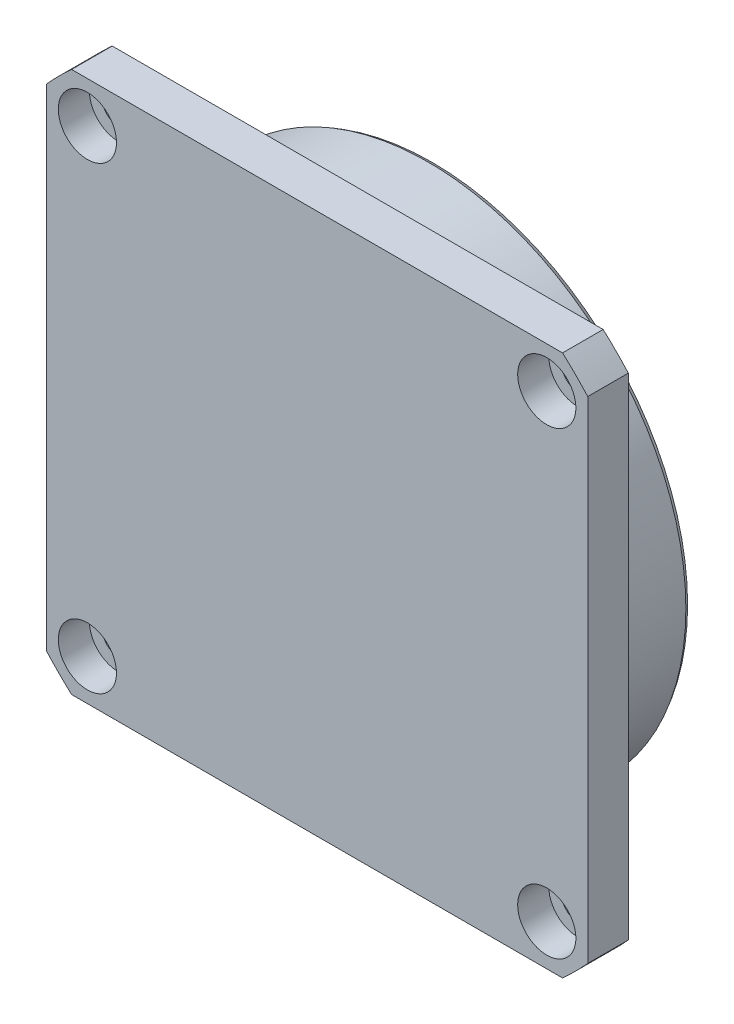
ISO-10303-21;
HEADER;
FILE_DESCRIPTION(('STEP AP214'),'2;1');
FILE_NAME('part.step','',(''),(''),'','','');
FILE_SCHEMA(('AUTOMOTIVE_DESIGN { 1 0 10303 214 1 1 1 1 }'));
ENDSEC;
DATA;
#1=APPLICATION_CONTEXT('core data for automotive mechanical design processes');
#2=APPLICATION_PROTOCOL_DEFINITION('international standard','automotive_design',2000,#1);
#3=PRODUCT_CONTEXT('',#1,'mechanical');
#4=PRODUCT('Part','Part','',(#3));
#5=PRODUCT_RELATED_PRODUCT_CATEGORY('part','',(#4));
#6=PRODUCT_DEFINITION_FORMATION('','',#4);
#7=PRODUCT_DEFINITION_CONTEXT('part definition',#1,'design');
#8=PRODUCT_DEFINITION('design','',#6,#7);
#9=PRODUCT_DEFINITION_SHAPE('','',#8);
#10=(LENGTH_UNIT() NAMED_UNIT(*) SI_UNIT(.MILLI.,.METRE.));
#11=(NAMED_UNIT(*) PLANE_ANGLE_UNIT() SI_UNIT($,.RADIAN.));
#12=(NAMED_UNIT(*) SI_UNIT($,.STERADIAN.) SOLID_ANGLE_UNIT());
#13=UNCERTAINTY_MEASURE_WITH_UNIT(LENGTH_MEASURE(1.E-05),#10,'distance_accuracy_value','');
#14=(GEOMETRIC_REPRESENTATION_CONTEXT(3) GLOBAL_UNCERTAINTY_ASSIGNED_CONTEXT((#13)) GLOBAL_UNIT_ASSIGNED_CONTEXT((#10,
#11,#12)) REPRESENTATION_CONTEXT('',''));
#15=CARTESIAN_POINT('',(0.,0.,0.));
#16=DIRECTION('',(0.,0.,1.));
#17=DIRECTION('',(1.,0.,0.));
#18=AXIS2_PLACEMENT_3D('',#15,#16,#17);
#19=CARTESIAN_POINT('',(0.,0.,1.5));
#20=DIRECTION('',(0.,0.,1.));
#21=DIRECTION('',(1.,0.,0.));
#22=AXIS2_PLACEMENT_3D('',#19,#20,#21);
#23=PLANE('',#22);
#24=CARTESIAN_POINT('',(0.,0.,1.5));
#25=DIRECTION('',(0.,0.,1.));
#26=DIRECTION('',(1.,0.,0.));
#27=AXIS2_PLACEMENT_3D('',#24,#25,#26);
#28=CIRCLE('',#27,14.);
#29=CARTESIAN_POINT('',(14.,0.,1.5));
#30=VERTEX_POINT('',#29);
#31=EDGE_CURVE('E250',#30,#30,#28,.F.);
#32=ORIENTED_EDGE('',*,*,#31,.T.);
#33=EDGE_LOOP('',(#32));
#34=FACE_BOUND('',#33,.T.);
#35=ADVANCED_FACE('F17',(#34),#23,.F.);
#36=CARTESIAN_POINT('',(0.,0.,0.5));
#37=DIRECTION('',(0.,0.,1.));
#38=DIRECTION('',(-1.,0.,0.));
#39=AXIS2_PLACEMENT_3D('',#36,#37,#38);
#40=TOROIDAL_SURFACE('',#39,14.,1.);
#41=CARTESIAN_POINT('',(0.,0.,0.5));
#42=DIRECTION('',(0.,0.,1.));
#43=DIRECTION('',(1.,0.,0.));
#44=AXIS2_PLACEMENT_3D('',#41,#42,#43);
#45=CIRCLE('',#44,15.);
#46=CARTESIAN_POINT('',(15.,0.,0.5));
#47=VERTEX_POINT('',#46);
#48=EDGE_CURVE('E241',#47,#47,#45,.F.);
#49=ORIENTED_EDGE('',*,*,#48,.T.);
#50=EDGE_LOOP('',(#49));
#51=FACE_BOUND('',#50,.T.);
#52=ORIENTED_EDGE('',*,*,#31,.F.);
#53=EDGE_LOOP('',(#52));
#54=FACE_BOUND('',#53,.T.);
#55=ADVANCED_FACE('F257',(#51,#54),#40,.F.);
#56=CARTESIAN_POINT('',(0.,0.,-5.5));
#57=DIRECTION('',(0.,0.,1.));
#58=DIRECTION('',(1.,0.,0.));
#59=AXIS2_PLACEMENT_3D('',#56,#57,#58);
#60=CYLINDRICAL_SURFACE('',#59,15.);
#61=CARTESIAN_POINT('',(0.,0.,-5.));
#62=DIRECTION('',(0.,0.,-1.));
#63=DIRECTION('',(1.,0.,0.));
#64=AXIS2_PLACEMENT_3D('',#61,#62,#63);
#65=CIRCLE('',#64,15.);
#66=CARTESIAN_POINT('',(15.,0.,-5.));
#67=VERTEX_POINT('',#66);
#68=EDGE_CURVE('E249',#67,#67,#65,.F.);
#69=ORIENTED_EDGE('',*,*,#68,.F.);
#70=EDGE_LOOP('',(#69));
#71=FACE_BOUND('',#70,.T.);
#72=ORIENTED_EDGE('',*,*,#48,.F.);
#73=EDGE_LOOP('',(#72));
#74=FACE_BOUND('',#73,.T.);
#75=ADVANCED_FACE('F233',(#71,#74),#60,.F.);
#76=CARTESIAN_POINT('',(0.,0.,-5.));
#77=DIRECTION('',(0.,0.,-1.));
#78=DIRECTION('',(1.,0.,0.));
#79=AXIS2_PLACEMENT_3D('',#76,#77,#78);
#80=TOROIDAL_SURFACE('',#79,15.5,0.5);
#81=CARTESIAN_POINT('',(0.,0.,-5.5));
#82=DIRECTION('',(0.,0.,-1.));
#83=DIRECTION('',(-1.,0.,0.));
#84=AXIS2_PLACEMENT_3D('',#81,#82,#83);
#85=CIRCLE('',#84,15.5);
#86=CARTESIAN_POINT('',(-15.5,0.,-5.5));
#87=VERTEX_POINT('',#86);
#88=EDGE_CURVE('E210',#87,#87,#85,.F.);
#89=ORIENTED_EDGE('',*,*,#88,.F.);
#90=EDGE_LOOP('',(#89));
#91=FACE_BOUND('',#90,.T.);
#92=ORIENTED_EDGE('',*,*,#68,.T.);
#93=EDGE_LOOP('',(#92));
#94=FACE_BOUND('',#93,.T.);
#95=ADVANCED_FACE('F228',(#91,#94),#80,.T.);
#96=CARTESIAN_POINT('',(0.,0.,-5.5));
#97=DIRECTION('',(0.,0.,-1.));
#98=DIRECTION('',(-1.,0.,0.));
#99=AXIS2_PLACEMENT_3D('',#96,#97,#98);
#100=PLANE('',#99);
#101=CARTESIAN_POINT('',(0.,0.,-5.5));
#102=DIRECTION('',(0.,0.,1.));
#103=DIRECTION('',(1.,0.,0.));
#104=AXIS2_PLACEMENT_3D('',#101,#102,#103);
#105=CIRCLE('',#104,18.8767949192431);
#106=CARTESIAN_POINT('',(18.8767949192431,0.,-5.5));
#107=VERTEX_POINT('',#106);
#108=EDGE_CURVE('E21',#107,#107,#105,.T.);
#109=ORIENTED_EDGE('',*,*,#108,.F.);
#110=EDGE_LOOP('',(#109));
#111=FACE_BOUND('',#110,.T.);
#112=ORIENTED_EDGE('',*,*,#88,.T.);
#113=EDGE_LOOP('',(#112));
#114=FACE_BOUND('',#113,.T.);
#115=ADVANCED_FACE('F217',(#111,#114),#100,.T.);
#116=CARTESIAN_POINT('',(0.,0.,-5.19999999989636));
#117=DIRECTION('',(0.,0.,1.));
#118=DIRECTION('',(1.,0.,0.));
#119=AXIS2_PLACEMENT_3D('',#116,#117,#118);
#120=CONICAL_SURFACE('',#119,19.0499999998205,0.523598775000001);
#121=ORIENTED_EDGE('',*,*,#108,.T.);
#122=EDGE_LOOP('',(#121));
#123=FACE_BOUND('',#122,.T.);
#124=CARTESIAN_POINT('',(0.,0.,-5.2));
#125=DIRECTION('',(0.,0.,-1.));
#126=DIRECTION('',(-1.,0.,0.));
#127=AXIS2_PLACEMENT_3D('',#124,#125,#126);
#128=CIRCLE('',#127,19.05);
#129=CARTESIAN_POINT('',(-19.05,0.,-5.2));
#130=VERTEX_POINT('',#129);
#131=EDGE_CURVE('E199',#130,#130,#128,.F.);
#132=ORIENTED_EDGE('',*,*,#131,.F.);
#133=EDGE_LOOP('',(#132));
#134=FACE_BOUND('',#133,.T.);
#135=ADVANCED_FACE('F227',(#123,#134),#120,.T.);
#136=CARTESIAN_POINT('',(0.,0.,0.));
#137=DIRECTION('',(0.,0.,-1.));
#138=DIRECTION('',(-1.,0.,0.));
#139=AXIS2_PLACEMENT_3D('',#136,#137,#138);
#140=CYLINDRICAL_SURFACE('',#139,19.05);
#141=ORIENTED_EDGE('',*,*,#131,.T.);
#142=EDGE_LOOP('',(#141));
#143=FACE_BOUND('',#142,.T.);
#144=CARTESIAN_POINT('',(0.,0.,-0.853589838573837));
#145=DIRECTION('',(0.,0.,-1.));
#146=DIRECTION('',(1.,0.,0.));
#147=AXIS2_PLACEMENT_3D('',#144,#145,#146);
#148=CIRCLE('',#147,19.0499999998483);
#149=CARTESIAN_POINT('',(19.0499999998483,0.,-0.853589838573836));
#150=VERTEX_POINT('',#149);
#151=EDGE_CURVE('E186',#150,#150,#148,.F.);
#152=ORIENTED_EDGE('',*,*,#151,.F.);
#153=EDGE_LOOP('',(#152));
#154=FACE_BOUND('',#153,.T.);
#155=ADVANCED_FACE('F512',(#143,#154),#140,.T.);
#156=CARTESIAN_POINT('',(0.,0.,-0.853589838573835));
#157=DIRECTION('',(0.,0.,-1.));
#158=DIRECTION('',(0.,1.,0.));
#159=AXIS2_PLACEMENT_3D('',#156,#157,#158);
#160=CONICAL_SURFACE('',#159,19.0499999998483,0.523598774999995);
#161=CARTESIAN_POINT('',(0.,0.,-0.599999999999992));
#162=DIRECTION('',(0.,0.,-1.));
#163=DIRECTION('',(1.,0.,0.));
#164=AXIS2_PLACEMENT_3D('',#161,#162,#163);
#165=CIRCLE('',#164,18.9035898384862);
#166=CARTESIAN_POINT('',(18.9035898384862,0.,-0.599999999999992));
#167=VERTEX_POINT('',#166);
#168=EDGE_CURVE('E182',#167,#167,#165,.T.);
#169=ORIENTED_EDGE('',*,*,#168,.T.);
#170=EDGE_LOOP('',(#169));
#171=FACE_BOUND('',#170,.T.);
#172=ORIENTED_EDGE('',*,*,#151,.T.);
#173=EDGE_LOOP('',(#172));
#174=FACE_BOUND('',#173,.T.);
#175=ADVANCED_FACE('F176',(#171,#174),#160,.T.);
#176=CARTESIAN_POINT('',(0.,0.,-0.400000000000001));
#177=DIRECTION('',(0.,0.,-1.));
#178=DIRECTION('',(1.,0.,0.));
#179=AXIS2_PLACEMENT_3D('',#176,#177,#178);
#180=TOROIDAL_SURFACE('',#179,19.25,0.4);
#181=CARTESIAN_POINT('',(0.,0.,0.));
#182=DIRECTION('',(0.,0.,-1.));
#183=DIRECTION('',(-1.,0.,0.));
#184=AXIS2_PLACEMENT_3D('',#181,#182,#183);
#185=CIRCLE('',#184,19.25);
#186=CARTESIAN_POINT('',(-19.25,0.,0.));
#187=VERTEX_POINT('',#186);
#188=EDGE_CURVE('E121',#187,#187,#185,.F.);
#189=ORIENTED_EDGE('',*,*,#188,.F.);
#190=EDGE_LOOP('',(#189));
#191=FACE_BOUND('',#190,.T.);
#192=ORIENTED_EDGE('',*,*,#168,.F.);
#193=EDGE_LOOP('',(#192));
#194=FACE_BOUND('',#193,.T.);
#195=ADVANCED_FACE('F170',(#191,#194),#180,.F.);
#196=CARTESIAN_POINT('',(-16.9705627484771,-16.9705627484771,-495001.999614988));
#197=DIRECTION('',(0.,0.,-1.));
#198=DIRECTION('',(-1.,0.,0.));
#199=AXIS2_PLACEMENT_3D('',#196,#197,#198);
#200=CYLINDRICAL_SURFACE('',#199,1.2);
#201=CARTESIAN_POINT('',(-16.9705627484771,-16.9705627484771,0.699999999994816));
#202=DIRECTION('',(0.,0.,-1.));
#203=DIRECTION('',(-1.,0.,0.));
#204=AXIS2_PLACEMENT_3D('',#201,#202,#203);
#205=CIRCLE('',#204,1.2);
#206=CARTESIAN_POINT('',(-18.1705627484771,-16.9705627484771,0.699999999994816));
#207=VERTEX_POINT('',#206);
#208=EDGE_CURVE('E324',#207,#207,#205,.F.);
#209=ORIENTED_EDGE('',*,*,#208,.T.);
#210=EDGE_LOOP('',(#209));
#211=FACE_BOUND('',#210,.T.);
#212=CARTESIAN_POINT('',(-16.9705627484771,-16.9705627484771,0.));
#213=DIRECTION('',(0.,0.,-1.));
#214=DIRECTION('',(-1.,0.,0.));
#215=AXIS2_PLACEMENT_3D('',#212,#213,#214);
#216=CIRCLE('',#215,1.2);
#217=CARTESIAN_POINT('',(-18.1705627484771,-16.9705627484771,0.));
#218=VERTEX_POINT('',#217);
#219=EDGE_CURVE('E321',#218,#218,#216,.F.);
#220=ORIENTED_EDGE('',*,*,#219,.F.);
#221=EDGE_LOOP('',(#220));
#222=FACE_BOUND('',#221,.T.);
#223=ADVANCED_FACE('F166',(#211,#222),#200,.F.);
#224=CARTESIAN_POINT('',(-16.9705627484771,16.9705627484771,-495001.999614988));
#225=DIRECTION('',(0.,0.,-1.));
#226=DIRECTION('',(-1.,0.,0.));
#227=AXIS2_PLACEMENT_3D('',#224,#225,#226);
#228=CYLINDRICAL_SURFACE('',#227,1.2);
#229=CARTESIAN_POINT('',(-16.9705627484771,16.9705627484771,0.699999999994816));
#230=DIRECTION('',(0.,0.,-1.));
#231=DIRECTION('',(-1.,0.,0.));
#232=AXIS2_PLACEMENT_3D('',#229,#230,#231);
#233=CIRCLE('',#232,1.2);
#234=CARTESIAN_POINT('',(-18.1705627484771,16.9705627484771,0.699999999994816));
#235=VERTEX_POINT('',#234);
#236=EDGE_CURVE('E327',#235,#235,#233,.F.);
#237=ORIENTED_EDGE('',*,*,#236,.T.);
#238=EDGE_LOOP('',(#237));
#239=FACE_BOUND('',#238,.T.);
#240=CARTESIAN_POINT('',(-16.9705627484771,16.9705627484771,0.));
#241=DIRECTION('',(0.,0.,-1.));
#242=DIRECTION('',(-1.,0.,0.));
#243=AXIS2_PLACEMENT_3D('',#240,#241,#242);
#244=CIRCLE('',#243,1.2);
#245=CARTESIAN_POINT('',(-18.1705627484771,16.9705627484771,0.));
#246=VERTEX_POINT('',#245);
#247=EDGE_CURVE('E318',#246,#246,#244,.F.);
#248=ORIENTED_EDGE('',*,*,#247,.F.);
#249=EDGE_LOOP('',(#248));
#250=FACE_BOUND('',#249,.T.);
#251=ADVANCED_FACE('F162',(#239,#250),#228,.F.);
#252=CARTESIAN_POINT('',(16.9705627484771,16.9705627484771,-495001.999614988));
#253=DIRECTION('',(0.,0.,-1.));
#254=DIRECTION('',(-1.,0.,0.));
#255=AXIS2_PLACEMENT_3D('',#252,#253,#254);
#256=CYLINDRICAL_SURFACE('',#255,1.2);
#257=CARTESIAN_POINT('',(16.9705627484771,16.9705627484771,0.699999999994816));
#258=DIRECTION('',(0.,0.,-1.));
#259=DIRECTION('',(-1.,0.,0.));
#260=AXIS2_PLACEMENT_3D('',#257,#258,#259);
#261=CIRCLE('',#260,1.2);
#262=CARTESIAN_POINT('',(15.7705627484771,16.9705627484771,0.699999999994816));
#263=VERTEX_POINT('',#262);
#264=EDGE_CURVE('E330',#263,#263,#261,.F.);
#265=ORIENTED_EDGE('',*,*,#264,.T.);
#266=EDGE_LOOP('',(#265));
#267=FACE_BOUND('',#266,.T.);
#268=CARTESIAN_POINT('',(16.9705627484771,16.9705627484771,0.));
#269=DIRECTION('',(0.,0.,-1.));
#270=DIRECTION('',(-1.,0.,0.));
#271=AXIS2_PLACEMENT_3D('',#268,#269,#270);
#272=CIRCLE('',#271,1.2);
#273=CARTESIAN_POINT('',(15.7705627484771,16.9705627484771,0.));
#274=VERTEX_POINT('',#273);
#275=EDGE_CURVE('E315',#274,#274,#272,.F.);
#276=ORIENTED_EDGE('',*,*,#275,.F.);
#277=EDGE_LOOP('',(#276));
#278=FACE_BOUND('',#277,.T.);
#279=ADVANCED_FACE('F158',(#267,#278),#256,.F.);
#280=CARTESIAN_POINT('',(16.9705627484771,-16.9705627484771,-495001.999614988));
#281=DIRECTION('',(0.,0.,-1.));
#282=DIRECTION('',(-1.,0.,0.));
#283=AXIS2_PLACEMENT_3D('',#280,#281,#282);
#284=CYLINDRICAL_SURFACE('',#283,1.2);
#285=CARTESIAN_POINT('',(16.9705627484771,-16.9705627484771,0.699999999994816));
#286=DIRECTION('',(0.,0.,-1.));
#287=DIRECTION('',(-1.,0.,0.));
#288=AXIS2_PLACEMENT_3D('',#285,#286,#287);
#289=CIRCLE('',#288,1.2);
#290=CARTESIAN_POINT('',(15.7705627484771,-16.9705627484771,0.699999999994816));
#291=VERTEX_POINT('',#290);
#292=EDGE_CURVE('E185',#291,#291,#289,.F.);
#293=ORIENTED_EDGE('',*,*,#292,.T.);
#294=EDGE_LOOP('',(#293));
#295=FACE_BOUND('',#294,.T.);
#296=CARTESIAN_POINT('',(16.9705627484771,-16.9705627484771,0.));
#297=DIRECTION('',(0.,0.,-1.));
#298=DIRECTION('',(-1.,0.,0.));
#299=AXIS2_PLACEMENT_3D('',#296,#297,#298);
#300=CIRCLE('',#299,1.2);
#301=CARTESIAN_POINT('',(15.7705627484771,-16.9705627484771,0.));
#302=VERTEX_POINT('',#301);
#303=EDGE_CURVE('E312',#302,#302,#300,.F.);
#304=ORIENTED_EDGE('',*,*,#303,.F.);
#305=EDGE_LOOP('',(#304));
#306=FACE_BOUND('',#305,.T.);
#307=ADVANCED_FACE('F154',(#295,#306),#284,.F.);
#308=CARTESIAN_POINT('',(16.9705627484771,-16.9705627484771,0.7));
#309=DIRECTION('',(0.,0.,-1.));
#310=DIRECTION('',(-1.,0.,0.));
#311=AXIS2_PLACEMENT_3D('',#308,#309,#310);
#312=PLANE('',#311);
#313=CARTESIAN_POINT('',(16.9705627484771,-16.9705627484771,0.7));
#314=DIRECTION('',(0.,0.,-1.));
#315=DIRECTION('',(-1.,0.,0.));
#316=AXIS2_PLACEMENT_3D('',#313,#314,#315);
#317=CIRCLE('',#316,2.15);
#318=CARTESIAN_POINT('',(14.8205627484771,-16.9705627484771,0.7));
#319=VERTEX_POINT('',#318);
#320=EDGE_CURVE('E309',#319,#319,#317,.F.);
#321=ORIENTED_EDGE('',*,*,#320,.T.);
#322=EDGE_LOOP('',(#321));
#323=FACE_BOUND('',#322,.T.);
#324=ORIENTED_EDGE('',*,*,#292,.F.);
#325=EDGE_LOOP('',(#324));
#326=FACE_BOUND('',#325,.T.);
#327=ADVANCED_FACE('F150',(#323,#326),#312,.F.);
#328=CARTESIAN_POINT('',(16.9705627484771,16.9705627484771,0.7));
#329=DIRECTION('',(0.,0.,-1.));
#330=DIRECTION('',(-1.,0.,0.));
#331=AXIS2_PLACEMENT_3D('',#328,#329,#330);
#332=PLANE('',#331);
#333=CARTESIAN_POINT('',(16.9705627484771,16.9705627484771,0.7));
#334=DIRECTION('',(0.,0.,-1.));
#335=DIRECTION('',(-1.,0.,0.));
#336=AXIS2_PLACEMENT_3D('',#333,#334,#335);
#337=CIRCLE('',#336,2.15);
#338=CARTESIAN_POINT('',(14.8205627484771,16.9705627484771,0.7));
#339=VERTEX_POINT('',#338);
#340=EDGE_CURVE('E306',#339,#339,#337,.F.);
#341=ORIENTED_EDGE('',*,*,#340,.T.);
#342=EDGE_LOOP('',(#341));
#343=FACE_BOUND('',#342,.T.);
#344=ORIENTED_EDGE('',*,*,#264,.F.);
#345=EDGE_LOOP('',(#344));
#346=FACE_BOUND('',#345,.T.);
#347=ADVANCED_FACE('F146',(#343,#346),#332,.F.);
#348=CARTESIAN_POINT('',(-16.9705627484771,16.9705627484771,0.7));
#349=DIRECTION('',(0.,0.,-1.));
#350=DIRECTION('',(-1.,0.,0.));
#351=AXIS2_PLACEMENT_3D('',#348,#349,#350);
#352=PLANE('',#351);
#353=CARTESIAN_POINT('',(-16.9705627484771,16.9705627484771,0.7));
#354=DIRECTION('',(0.,0.,-1.));
#355=DIRECTION('',(-1.,0.,0.));
#356=AXIS2_PLACEMENT_3D('',#353,#354,#355);
#357=CIRCLE('',#356,2.15);
#358=CARTESIAN_POINT('',(-19.1205627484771,16.9705627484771,0.7));
#359=VERTEX_POINT('',#358);
#360=EDGE_CURVE('E303',#359,#359,#357,.F.);
#361=ORIENTED_EDGE('',*,*,#360,.T.);
#362=EDGE_LOOP('',(#361));
#363=FACE_BOUND('',#362,.T.);
#364=ORIENTED_EDGE('',*,*,#236,.F.);
#365=EDGE_LOOP('',(#364));
#366=FACE_BOUND('',#365,.T.);
#367=ADVANCED_FACE('F142',(#363,#366),#352,.F.);
#368=CARTESIAN_POINT('',(-16.9705627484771,-16.9705627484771,0.7));
#369=DIRECTION('',(0.,0.,-1.));
#370=DIRECTION('',(-1.,0.,0.));
#371=AXIS2_PLACEMENT_3D('',#368,#369,#370);
#372=PLANE('',#371);
#373=CARTESIAN_POINT('',(-16.9705627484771,-16.9705627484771,0.7));
#374=DIRECTION('',(0.,0.,-1.));
#375=DIRECTION('',(-1.,0.,0.));
#376=AXIS2_PLACEMENT_3D('',#373,#374,#375);
#377=CIRCLE('',#376,2.15);
#378=CARTESIAN_POINT('',(-19.1205627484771,-16.9705627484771,0.7));
#379=VERTEX_POINT('',#378);
#380=EDGE_CURVE('E104',#379,#379,#377,.F.);
#381=ORIENTED_EDGE('',*,*,#380,.T.);
#382=EDGE_LOOP('',(#381));
#383=FACE_BOUND('',#382,.T.);
#384=ORIENTED_EDGE('',*,*,#208,.F.);
#385=EDGE_LOOP('',(#384));
#386=FACE_BOUND('',#385,.T.);
#387=ADVANCED_FACE('F137',(#383,#386),#372,.F.);
#388=CARTESIAN_POINT('',(0.,0.,0.));
#389=DIRECTION('',(0.,0.,-1.));
#390=DIRECTION('',(-1.,0.,0.));
#391=AXIS2_PLACEMENT_3D('',#388,#389,#390);
#392=PLANE('',#391);
#393=ORIENTED_EDGE('',*,*,#303,.T.);
#394=EDGE_LOOP('',(#393));
#395=FACE_BOUND('',#394,.T.);
#396=ORIENTED_EDGE('',*,*,#275,.T.);
#397=EDGE_LOOP('',(#396));
#398=FACE_BOUND('',#397,.T.);
#399=ORIENTED_EDGE('',*,*,#247,.T.);
#400=EDGE_LOOP('',(#399));
#401=FACE_BOUND('',#400,.T.);
#402=ORIENTED_EDGE('',*,*,#219,.T.);
#403=EDGE_LOOP('',(#402));
#404=FACE_BOUND('',#403,.T.);
#405=CARTESIAN_POINT('',(0.,0.,0.));
#406=DIRECTION('',(0.,0.,-1.));
#407=DIRECTION('',(-1.,0.,0.));
#408=AXIS2_PLACEMENT_3D('',#405,#406,#407);
#409=CIRCLE('',#408,27.);
#410=CARTESIAN_POINT('',(18.1383571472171,-20.,0.));
#411=VERTEX_POINT('',#410);
#412=CARTESIAN_POINT('',(20.,-18.1383571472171,0.));
#413=VERTEX_POINT('',#412);
#414=EDGE_CURVE('E296',#411,#413,#409,.F.);
#415=ORIENTED_EDGE('',*,*,#414,.F.);
#416=DIRECTION('',(1.,0.,0.));
#417=VECTOR('',#416,1.);
#418=CARTESIAN_POINT('',(0.,-20.,0.));
#419=LINE('',#418,#417);
#420=CARTESIAN_POINT('',(-18.1383571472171,-20.,0.));
#421=VERTEX_POINT('',#420);
#422=EDGE_CURVE('E114',#421,#411,#419,.T.);
#423=ORIENTED_EDGE('',*,*,#422,.F.);
#424=CARTESIAN_POINT('',(0.,0.,0.));
#425=DIRECTION('',(0.,0.,-1.));
#426=DIRECTION('',(-1.,0.,0.));
#427=AXIS2_PLACEMENT_3D('',#424,#425,#426);
#428=CIRCLE('',#427,27.);
#429=CARTESIAN_POINT('',(-20.,-18.1383571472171,0.));
#430=VERTEX_POINT('',#429);
#431=EDGE_CURVE('E100',#430,#421,#428,.F.);
#432=ORIENTED_EDGE('',*,*,#431,.F.);
#433=DIRECTION('',(0.,1.,0.));
#434=VECTOR('',#433,1.);
#435=CARTESIAN_POINT('',(-20.,18.1383571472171,0.));
#436=LINE('',#435,#434);
#437=CARTESIAN_POINT('',(-20.,18.1383571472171,0.));
#438=VERTEX_POINT('',#437);
#439=EDGE_CURVE('E93',#430,#438,#436,.T.);
#440=ORIENTED_EDGE('',*,*,#439,.T.);
#441=CARTESIAN_POINT('',(0.,0.,0.));
#442=DIRECTION('',(0.,0.,-1.));
#443=DIRECTION('',(-1.,0.,0.));
#444=AXIS2_PLACEMENT_3D('',#441,#442,#443);
#445=CIRCLE('',#444,27.);
#446=CARTESIAN_POINT('',(-18.1383571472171,20.,0.));
#447=VERTEX_POINT('',#446);
#448=EDGE_CURVE('E84',#447,#438,#445,.F.);
#449=ORIENTED_EDGE('',*,*,#448,.F.);
#450=DIRECTION('',(1.,0.,0.));
#451=VECTOR('',#450,1.);
#452=CARTESIAN_POINT('',(0.,20.,0.));
#453=LINE('',#452,#451);
#454=CARTESIAN_POINT('',(18.1383571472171,20.,0.));
#455=VERTEX_POINT('',#454);
#456=EDGE_CURVE('E79',#455,#447,#453,.F.);
#457=ORIENTED_EDGE('',*,*,#456,.F.);
#458=CARTESIAN_POINT('',(0.,0.,0.));
#459=DIRECTION('',(0.,0.,-1.));
#460=DIRECTION('',(-1.,0.,0.));
#461=AXIS2_PLACEMENT_3D('',#458,#459,#460);
#462=CIRCLE('',#461,27.);
#463=CARTESIAN_POINT('',(20.,18.1383571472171,0.));
#464=VERTEX_POINT('',#463);
#465=EDGE_CURVE('E298',#464,#455,#462,.F.);
#466=ORIENTED_EDGE('',*,*,#465,.F.);
#467=DIRECTION('',(0.,1.,0.));
#468=VECTOR('',#467,1.);
#469=CARTESIAN_POINT('',(20.,-18.1383571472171,0.));
#470=LINE('',#469,#468);
#471=EDGE_CURVE('E126',#464,#413,#470,.F.);
#472=ORIENTED_EDGE('',*,*,#471,.T.);
#473=EDGE_LOOP('',(#415,#423,#432,#440,#449,#457,#466,#472));
#474=FACE_BOUND('',#473,.T.);
#475=ORIENTED_EDGE('',*,*,#188,.T.);
#476=EDGE_LOOP('',(#475));
#477=FACE_BOUND('',#476,.T.);
#478=ADVANCED_FACE('F97',(#395,#398,#401,#404,#474,#477),#392,.T.);
#479=CARTESIAN_POINT('',(16.9705627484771,-16.9705627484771,3.));
#480=DIRECTION('',(0.,0.,-1.));
#481=DIRECTION('',(-1.,0.,0.));
#482=AXIS2_PLACEMENT_3D('',#479,#480,#481);
#483=CYLINDRICAL_SURFACE('',#482,2.15);
#484=CARTESIAN_POINT('',(16.9705627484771,-16.9705627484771,3.));
#485=DIRECTION('',(0.,0.,-1.));
#486=DIRECTION('',(-1.,0.,0.));
#487=AXIS2_PLACEMENT_3D('',#484,#485,#486);
#488=CIRCLE('',#487,2.15);
#489=CARTESIAN_POINT('',(14.8205627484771,-16.9705627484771,3.));
#490=VERTEX_POINT('',#489);
#491=EDGE_CURVE('E291',#490,#490,#488,.F.);
#492=ORIENTED_EDGE('',*,*,#491,.T.);
#493=EDGE_LOOP('',(#492));
#494=FACE_BOUND('',#493,.T.);
#495=ORIENTED_EDGE('',*,*,#320,.F.);
#496=EDGE_LOOP('',(#495));
#497=FACE_BOUND('',#496,.T.);
#498=ADVANCED_FACE('F136',(#494,#497),#483,.F.);
#499=CARTESIAN_POINT('',(16.9705627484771,16.9705627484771,3.));
#500=DIRECTION('',(0.,0.,-1.));
#501=DIRECTION('',(-1.,0.,0.));
#502=AXIS2_PLACEMENT_3D('',#499,#500,#501);
#503=CYLINDRICAL_SURFACE('',#502,2.15);
#504=CARTESIAN_POINT('',(16.9705627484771,16.9705627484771,3.));
#505=DIRECTION('',(0.,0.,-1.));
#506=DIRECTION('',(-1.,0.,0.));
#507=AXIS2_PLACEMENT_3D('',#504,#505,#506);
#508=CIRCLE('',#507,2.15);
#509=CARTESIAN_POINT('',(14.8205627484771,16.9705627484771,3.));
#510=VERTEX_POINT('',#509);
#511=EDGE_CURVE('E288',#510,#510,#508,.F.);
#512=ORIENTED_EDGE('',*,*,#511,.T.);
#513=EDGE_LOOP('',(#512));
#514=FACE_BOUND('',#513,.T.);
#515=ORIENTED_EDGE('',*,*,#340,.F.);
#516=EDGE_LOOP('',(#515));
#517=FACE_BOUND('',#516,.T.);
#518=ADVANCED_FACE('F355',(#514,#517),#503,.F.);
#519=CARTESIAN_POINT('',(-16.9705627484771,16.9705627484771,3.));
#520=DIRECTION('',(0.,0.,-1.));
#521=DIRECTION('',(-1.,0.,0.));
#522=AXIS2_PLACEMENT_3D('',#519,#520,#521);
#523=CYLINDRICAL_SURFACE('',#522,2.15);
#524=CARTESIAN_POINT('',(-16.9705627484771,16.9705627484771,3.));
#525=DIRECTION('',(0.,0.,-1.));
#526=DIRECTION('',(-1.,0.,0.));
#527=AXIS2_PLACEMENT_3D('',#524,#525,#526);
#528=CIRCLE('',#527,2.15);
#529=CARTESIAN_POINT('',(-19.1205627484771,16.9705627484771,3.));
#530=VERTEX_POINT('',#529);
#531=EDGE_CURVE('E285',#530,#530,#528,.F.);
#532=ORIENTED_EDGE('',*,*,#531,.T.);
#533=EDGE_LOOP('',(#532));
#534=FACE_BOUND('',#533,.T.);
#535=ORIENTED_EDGE('',*,*,#360,.F.);
#536=EDGE_LOOP('',(#535));
#537=FACE_BOUND('',#536,.T.);
#538=ADVANCED_FACE('F361',(#534,#537),#523,.F.);
#539=CARTESIAN_POINT('',(-16.9705627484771,-16.9705627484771,3.));
#540=DIRECTION('',(0.,0.,-1.));
#541=DIRECTION('',(-1.,0.,0.));
#542=AXIS2_PLACEMENT_3D('',#539,#540,#541);
#543=CYLINDRICAL_SURFACE('',#542,2.15);
#544=CARTESIAN_POINT('',(-16.9705627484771,-16.9705627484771,3.));
#545=DIRECTION('',(0.,0.,-1.));
#546=DIRECTION('',(-1.,0.,0.));
#547=AXIS2_PLACEMENT_3D('',#544,#545,#546);
#548=CIRCLE('',#547,2.15);
#549=CARTESIAN_POINT('',(-19.1205627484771,-16.9705627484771,3.));
#550=VERTEX_POINT('',#549);
#551=EDGE_CURVE('E282',#550,#550,#548,.F.);
#552=ORIENTED_EDGE('',*,*,#551,.T.);
#553=EDGE_LOOP('',(#552));
#554=FACE_BOUND('',#553,.T.);
#555=ORIENTED_EDGE('',*,*,#380,.F.);
#556=EDGE_LOOP('',(#555));
#557=FACE_BOUND('',#556,.T.);
#558=ADVANCED_FACE('F398',(#554,#557),#543,.F.);
#559=CARTESIAN_POINT('',(-20.,18.1383571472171,3.));
#560=DIRECTION('',(1.,0.,0.));
#561=DIRECTION('',(0.,0.,-1.));
#562=AXIS2_PLACEMENT_3D('',#559,#560,#561);
#563=PLANE('',#562);
#564=DIRECTION('',(0.,0.,-1.));
#565=VECTOR('',#564,1.);
#566=CARTESIAN_POINT('',(-20.,-18.1383571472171,3.));
#567=LINE('',#566,#565);
#568=CARTESIAN_POINT('',(-20.,-18.1383571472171,3.));
#569=VERTEX_POINT('',#568);
#570=EDGE_CURVE('E294',#569,#430,#567,.T.);
#571=ORIENTED_EDGE('',*,*,#570,.F.);
#572=DIRECTION('',(0.,1.,0.));
#573=VECTOR('',#572,1.);
#574=CARTESIAN_POINT('',(-20.,0.,3.));
#575=LINE('',#574,#573);
#576=CARTESIAN_POINT('',(-20.,18.1383571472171,3.));
#577=VERTEX_POINT('',#576);
#578=EDGE_CURVE('E108',#569,#577,#575,.T.);
#579=ORIENTED_EDGE('',*,*,#578,.T.);
#580=DIRECTION('',(0.,0.,-1.));
#581=VECTOR('',#580,1.);
#582=CARTESIAN_POINT('',(-20.,18.1383571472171,3.));
#583=LINE('',#582,#581);
#584=EDGE_CURVE('E89',#438,#577,#583,.F.);
#585=ORIENTED_EDGE('',*,*,#584,.F.);
#586=ORIENTED_EDGE('',*,*,#439,.F.);
#587=EDGE_LOOP('',(#571,#579,#585,#586));
#588=FACE_BOUND('',#587,.T.);
#589=ADVANCED_FACE('F107',(#588),#563,.F.);
#590=CARTESIAN_POINT('',(0.,0.,3.));
#591=DIRECTION('',(0.,0.,-1.));
#592=DIRECTION('',(-1.,0.,0.));
#593=AXIS2_PLACEMENT_3D('',#590,#591,#592);
#594=CYLINDRICAL_SURFACE('',#593,27.);
#595=CARTESIAN_POINT('',(0.,0.,3.));
#596=DIRECTION('',(0.,0.,-1.));
#597=DIRECTION('',(-1.,0.,0.));
#598=AXIS2_PLACEMENT_3D('',#595,#596,#597);
#599=CIRCLE('',#598,27.);
#600=CARTESIAN_POINT('',(-18.1383571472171,20.,3.));
#601=VERTEX_POINT('',#600);
#602=EDGE_CURVE('E280',#577,#601,#599,.T.);
#603=ORIENTED_EDGE('',*,*,#602,.T.);
#604=DIRECTION('',(0.,0.,1.));
#605=VECTOR('',#604,1.);
#606=CARTESIAN_POINT('',(-18.1383571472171,20.,3.));
#607=LINE('',#606,#605);
#608=EDGE_CURVE('E91',#447,#601,#607,.T.);
#609=ORIENTED_EDGE('',*,*,#608,.F.);
#610=ORIENTED_EDGE('',*,*,#448,.T.);
#611=ORIENTED_EDGE('',*,*,#584,.T.);
#612=EDGE_LOOP('',(#603,#609,#610,#611));
#613=FACE_BOUND('',#612,.T.);
#614=ADVANCED_FACE('F87',(#613),#594,.T.);
#615=CARTESIAN_POINT('',(0.,20.,3.));
#616=DIRECTION('',(0.,1.,0.));
#617=DIRECTION('',(0.,0.,1.));
#618=AXIS2_PLACEMENT_3D('',#615,#616,#617);
#619=PLANE('',#618);
#620=DIRECTION('',(-1.,0.,0.));
#621=VECTOR('',#620,1.);
#622=CARTESIAN_POINT('',(0.,20.,3.));
#623=LINE('',#622,#621);
#624=CARTESIAN_POINT('',(18.1383571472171,20.,3.));
#625=VERTEX_POINT('',#624);
#626=EDGE_CURVE('E279',#601,#625,#623,.F.);
#627=ORIENTED_EDGE('',*,*,#626,.T.);
#628=DIRECTION('',(0.,0.,-1.));
#629=VECTOR('',#628,1.);
#630=CARTESIAN_POINT('',(18.1383571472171,20.,3.));
#631=LINE('',#630,#629);
#632=EDGE_CURVE('E299',#455,#625,#631,.F.);
#633=ORIENTED_EDGE('',*,*,#632,.F.);
#634=ORIENTED_EDGE('',*,*,#456,.T.);
#635=ORIENTED_EDGE('',*,*,#608,.T.);
#636=EDGE_LOOP('',(#627,#633,#634,#635));
#637=FACE_BOUND('',#636,.T.);
#638=ADVANCED_FACE('F390',(#637),#619,.T.);
#639=CARTESIAN_POINT('',(0.,0.,3.));
#640=DIRECTION('',(0.,0.,-1.));
#641=DIRECTION('',(-1.,0.,0.));
#642=AXIS2_PLACEMENT_3D('',#639,#640,#641);
#643=CYLINDRICAL_SURFACE('',#642,27.);
#644=CARTESIAN_POINT('',(0.,0.,3.));
#645=DIRECTION('',(0.,0.,-1.));
#646=DIRECTION('',(-1.,0.,0.));
#647=AXIS2_PLACEMENT_3D('',#644,#645,#646);
#648=CIRCLE('',#647,27.);
#649=CARTESIAN_POINT('',(20.,18.1383571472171,3.));
#650=VERTEX_POINT('',#649);
#651=EDGE_CURVE('E276',#625,#650,#648,.T.);
#652=ORIENTED_EDGE('',*,*,#651,.T.);
#653=DIRECTION('',(0.,0.,1.));
#654=VECTOR('',#653,1.);
#655=CARTESIAN_POINT('',(20.,18.1383571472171,3.));
#656=LINE('',#655,#654);
#657=EDGE_CURVE('E581',#650,#464,#656,.F.);
#658=ORIENTED_EDGE('',*,*,#657,.T.);
#659=ORIENTED_EDGE('',*,*,#465,.T.);
#660=ORIENTED_EDGE('',*,*,#632,.T.);
#661=EDGE_LOOP('',(#652,#658,#659,#660));
#662=FACE_BOUND('',#661,.T.);
#663=ADVANCED_FACE('F386',(#662),#643,.T.);
#664=CARTESIAN_POINT('',(20.,-18.1383571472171,3.));
#665=DIRECTION('',(-1.,0.,0.));
#666=DIRECTION('',(0.,0.,1.));
#667=AXIS2_PLACEMENT_3D('',#664,#665,#666);
#668=PLANE('',#667);
#669=ORIENTED_EDGE('',*,*,#657,.F.);
#670=DIRECTION('',(0.,1.,0.));
#671=VECTOR('',#670,1.);
#672=CARTESIAN_POINT('',(20.,0.,3.));
#673=LINE('',#672,#671);
#674=CARTESIAN_POINT('',(20.,-18.1383571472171,3.));
#675=VERTEX_POINT('',#674);
#676=EDGE_CURVE('E275',#650,#675,#673,.F.);
#677=ORIENTED_EDGE('',*,*,#676,.T.);
#678=DIRECTION('',(0.,0.,-1.));
#679=VECTOR('',#678,1.);
#680=CARTESIAN_POINT('',(20.,-18.1383571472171,3.));
#681=LINE('',#680,#679);
#682=EDGE_CURVE('E117',#413,#675,#681,.F.);
#683=ORIENTED_EDGE('',*,*,#682,.F.);
#684=ORIENTED_EDGE('',*,*,#471,.F.);
#685=EDGE_LOOP('',(#669,#677,#683,#684));
#686=FACE_BOUND('',#685,.T.);
#687=ADVANCED_FACE('F382',(#686),#668,.F.);
#688=CARTESIAN_POINT('',(0.,0.,3.));
#689=DIRECTION('',(0.,0.,-1.));
#690=DIRECTION('',(-1.,0.,0.));
#691=AXIS2_PLACEMENT_3D('',#688,#689,#690);
#692=CYLINDRICAL_SURFACE('',#691,27.);
#693=CARTESIAN_POINT('',(0.,0.,3.));
#694=DIRECTION('',(0.,0.,-1.));
#695=DIRECTION('',(-1.,0.,0.));
#696=AXIS2_PLACEMENT_3D('',#693,#694,#695);
#697=CIRCLE('',#696,27.);
#698=CARTESIAN_POINT('',(18.1383571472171,-20.,3.));
#699=VERTEX_POINT('',#698);
#700=EDGE_CURVE('E272',#675,#699,#697,.T.);
#701=ORIENTED_EDGE('',*,*,#700,.T.);
#702=DIRECTION('',(0.,0.,-1.));
#703=VECTOR('',#702,1.);
#704=CARTESIAN_POINT('',(18.1383571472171,-20.,3.));
#705=LINE('',#704,#703);
#706=EDGE_CURVE('E116',#411,#699,#705,.F.);
#707=ORIENTED_EDGE('',*,*,#706,.F.);
#708=ORIENTED_EDGE('',*,*,#414,.T.);
#709=ORIENTED_EDGE('',*,*,#682,.T.);
#710=EDGE_LOOP('',(#701,#707,#708,#709));
#711=FACE_BOUND('',#710,.T.);
#712=ADVANCED_FACE('F378',(#711),#692,.T.);
#713=CARTESIAN_POINT('',(0.,-20.,3.));
#714=DIRECTION('',(0.,-1.,0.));
#715=DIRECTION('',(0.,0.,-1.));
#716=AXIS2_PLACEMENT_3D('',#713,#714,#715);
#717=PLANE('',#716);
#718=DIRECTION('',(-1.,0.,0.));
#719=VECTOR('',#718,1.);
#720=CARTESIAN_POINT('',(0.,-20.,3.));
#721=LINE('',#720,#719);
#722=CARTESIAN_POINT('',(-18.1383571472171,-20.,3.));
#723=VERTEX_POINT('',#722);
#724=EDGE_CURVE('E27',#699,#723,#721,.T.);
#725=ORIENTED_EDGE('',*,*,#724,.T.);
#726=DIRECTION('',(0.,0.,-1.));
#727=VECTOR('',#726,1.);
#728=CARTESIAN_POINT('',(-18.1383571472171,-20.,3.));
#729=LINE('',#728,#727);
#730=EDGE_CURVE('E35',#421,#723,#729,.F.);
#731=ORIENTED_EDGE('',*,*,#730,.F.);
#732=ORIENTED_EDGE('',*,*,#422,.T.);
#733=ORIENTED_EDGE('',*,*,#706,.T.);
#734=EDGE_LOOP('',(#725,#731,#732,#733));
#735=FACE_BOUND('',#734,.T.);
#736=ADVANCED_FACE('F371',(#735),#717,.T.);
#737=CARTESIAN_POINT('',(0.,0.,3.));
#738=DIRECTION('',(0.,0.,-1.));
#739=DIRECTION('',(-1.,0.,0.));
#740=AXIS2_PLACEMENT_3D('',#737,#738,#739);
#741=CYLINDRICAL_SURFACE('',#740,27.);
#742=CARTESIAN_POINT('',(0.,0.,3.));
#743=DIRECTION('',(0.,0.,-1.));
#744=DIRECTION('',(-1.,0.,0.));
#745=AXIS2_PLACEMENT_3D('',#742,#743,#744);
#746=CIRCLE('',#745,27.);
#747=EDGE_CURVE('E11',#723,#569,#746,.T.);
#748=ORIENTED_EDGE('',*,*,#747,.T.);
#749=ORIENTED_EDGE('',*,*,#570,.T.);
#750=ORIENTED_EDGE('',*,*,#431,.T.);
#751=ORIENTED_EDGE('',*,*,#730,.T.);
#752=EDGE_LOOP('',(#748,#749,#750,#751));
#753=FACE_BOUND('',#752,.T.);
#754=ADVANCED_FACE('F365',(#753),#741,.T.);
#755=CARTESIAN_POINT('',(0.,0.,3.));
#756=DIRECTION('',(0.,0.,-1.));
#757=DIRECTION('',(-1.,0.,0.));
#758=AXIS2_PLACEMENT_3D('',#755,#756,#757);
#759=PLANE('',#758);
#760=ORIENTED_EDGE('',*,*,#724,.F.);
#761=ORIENTED_EDGE('',*,*,#700,.F.);
#762=ORIENTED_EDGE('',*,*,#676,.F.);
#763=ORIENTED_EDGE('',*,*,#651,.F.);
#764=ORIENTED_EDGE('',*,*,#626,.F.);
#765=ORIENTED_EDGE('',*,*,#602,.F.);
#766=ORIENTED_EDGE('',*,*,#578,.F.);
#767=ORIENTED_EDGE('',*,*,#747,.F.);
#768=EDGE_LOOP('',(#760,#761,#762,#763,#764,#765,#766,#767));
#769=FACE_BOUND('',#768,.T.);
#770=ORIENTED_EDGE('',*,*,#551,.F.);
#771=EDGE_LOOP('',(#770));
#772=FACE_BOUND('',#771,.T.);
#773=ORIENTED_EDGE('',*,*,#531,.F.);
#774=EDGE_LOOP('',(#773));
#775=FACE_BOUND('',#774,.T.);
#776=ORIENTED_EDGE('',*,*,#511,.F.);
#777=EDGE_LOOP('',(#776));
#778=FACE_BOUND('',#777,.T.);
#779=ORIENTED_EDGE('',*,*,#491,.F.);
#780=EDGE_LOOP('',(#779));
#781=FACE_BOUND('',#780,.T.);
#782=ADVANCED_FACE('F363',(#769,#772,#775,#778,#781),#759,.F.);
#783=CLOSED_SHELL('',(#35,#55,#75,#95,#115,#135,#155,#175,#195,#223,#251,#279,#307,#327,#347,
#367,#387,#478,#498,#518,#538,#558,#589,#614,#638,#663,#687,#712,#736,#754,#782));
#784=MANIFOLD_SOLID_BREP('B1',#783);
#785=ADVANCED_BREP_SHAPE_REPRESENTATION('',(#18,#784),#14);
#786=SHAPE_DEFINITION_REPRESENTATION(#9,#785);
ENDSEC;
END-ISO-10303-21;
